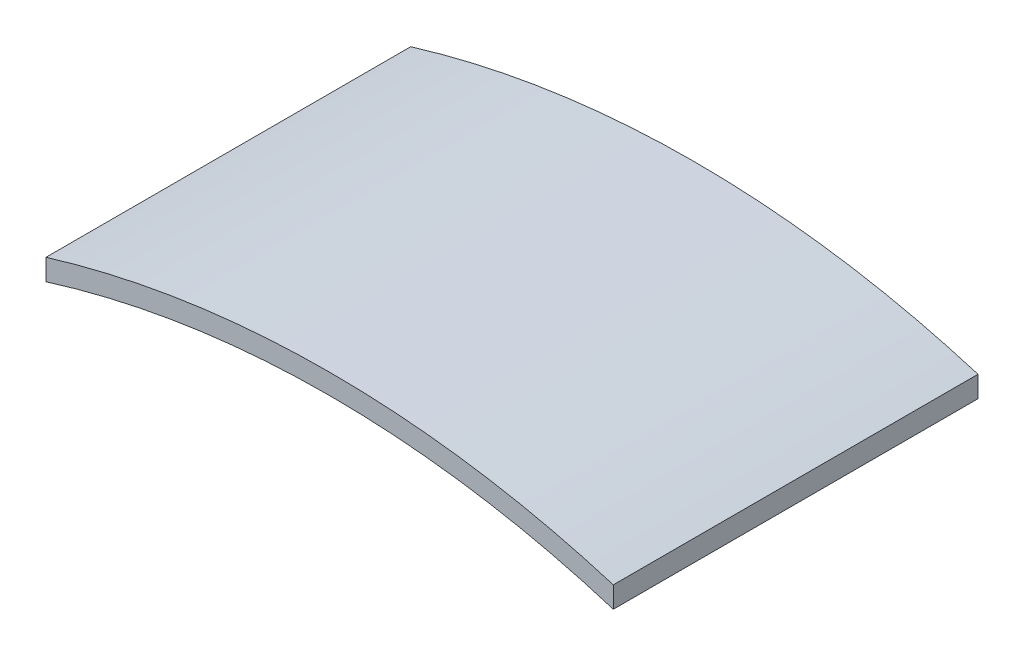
from build123d import *

# Parameters (mm, degrees)
EXTRUDE4_DEPTH = 28.575


with BuildPart() as part:
    # Sketch1 → Extrude4 (new body)
    with BuildSketch(Plane.XY):
        with BuildLine():
            Line((22.225, 71.225518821), (22.225, 72.886825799))
            ThreePointArc((22.225, 72.886825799), (0, 76.2), (-22.225, 72.886825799))
            Line((-22.225, 72.886825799), (-22.225, 71.225518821))
            ThreePointArc((-22.225, 71.225518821), (0, 74.6125), (22.225, 71.225518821))
        make_face()
    extrude(amount=EXTRUDE4_DEPTH)


solid = part.part
